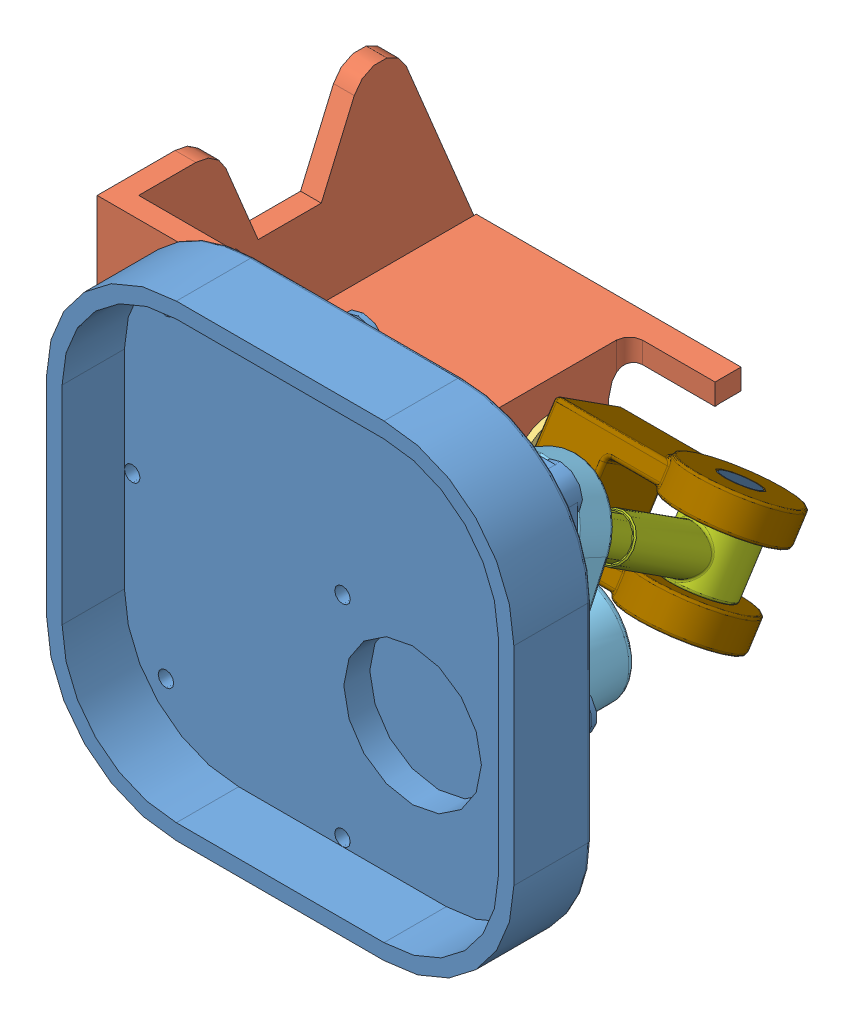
SolidWorks assembly Sinusmatic.sldasm, configuration Défaut (file format 4700). Lengths in mm.
Overall size (506 525.27 473.59).
18 component instances, 12 part files, 8 mates.
Components (placement in the parent):
- Bati-1: Bati.sldasm [Défaut] at (34.0419 25.9639 91) size (406 360 356)
  - Reducteur-1: Reducteur.sldprt [Défaut] at (-252.4721 -127.2379 27) size (360 360 174)
  - Bati-1: Bati.sldprt [Défaut] at (-293.4721 42.2621 7) x (0 -1 0) z (1 0 0) size (301 276 243)
  - Bague-1: Bague.sldprt [Défaut] at (-134.4721 -7.2379 -190) x (-1 0 0) z (0 0.924225 -0.381849) size (50 68.6 68.6)
  - Bague-2: Bague.sldprt [Défaut] at (-298.4721 -7.2379 -190) x (1 0 0) z (0 0.094472 0.995528) size (50 68.6 68.6)
  - Vis-1: Vis.sldprt [M8-1.25] at (-208.4721 -71.2379 -9) x (0.133526 0.991045 0) z (0 0 -1) size (27 27 38.26)
  - Vis-2: Vis.sldprt [M8-1.25] at (-72.4721 52.7621 -9) x (0.375037 -0.92701 0) z (0 0 -1) size (27 27 38.26)
  - Vis-3: Vis.sldprt [M8-1.25] at (-208.4721 176.7621 -9) x (0.607105 -0.794622 0) z (0 0 -1) size (27 27 38.26)
- Plateau-1: Plateau.sldasm [Défaut] at (16.4935 140.2032 101.5403) x (0 1 0) z (-1 0 0) size (174.55 96 88.14)
  - Plateau-1: Plateau.sldprt [Défaut] at (-121.4772 3.5403 0.9236) size (174.55 96 88.14)
  - Loctite-1: Loctite.sldprt [Défaut] at (-36.6458 68.708 0.9236) x (-0.167203 -0.077968 -0.982835) z (0.890751 0.415364 -0.184488) size (59.2 20 59.2)
- Croisillon-1: Croisillon.sldprt [Défaut] at (15.5699 67.698 -22.8949) x (1 0 0) z (0 0.541128 0.84094) size (50 40 175.5)
- Rotule-1: Rotule.sldprt [Défaut] at (15.5699 103.5574 32.8323) x (-0.210373 0.822121 -0.529018) z (0.977621 0.176911 -0.113839) size (49 28 49)
- Porte-1: Porte.sldasm [Défaut] at (-193.5468 -0.1439 -86.8576) x (-1 0 0) z (0 -0.541128 -0.84094) size (420 268.69 253.92)
  - Arbrefourche-1: Arbrefourche.sldprt [Défaut] at (-93.1167 22.439 0) size (420 88 80)
  - Goupille-1: Goupille.sldprt [Défaut] at (-209.1167 66.439 0) x (-0.047297 0 -0.998881) z (0 -1 0) size (30 30 88)
  - Barre-1: Barre.sldprt [Défaut] at (97.8833 22.439 0) x (0 0.741413 -0.671049) z (-1 0 0) size (290 80 50)
  - Ecrou-1: Ecrou.sldprt [M8-1.25] at (122.8833 22.439 0) x (0 -0.171163 -0.985243) z (1 0 0) size (80 80 28.76)
Mates (geometry in assembly coordinates):
- Coïncidente1: coincident anti-aligned: plane of Bati-1/Reducteur-1 through (15.5699 18.726 98) normal (0 0 -1); plane of Plateau-1/Plateau-1 through (15.5699 -14.974 98) normal (0 0 1)
- Concentrique1: concentric anti-aligned: cylinder of Bati-1/Reducteur-1 through (15.5699 18.726 4) axis (0 0 1) radius 18.5; cylinder of Plateau-1/Plateau-1 through (15.5699 18.726 -3.2789) axis (0 0 -1) radius 18.5
- Coïncidente2: coincident: point of Plateau-1/Loctite-1; point of Rotule-1
- Concentrique2: concentric anti-aligned: cylinder of Croisillon-1 through (15.5699 100.1657 27.5615) axis (0 -0.541128 -0.84094) radius 14.6; cylinder of Rotule-1 through (15.5699 114.7597 50.2413) axis (0 0.541128 0.84094) radius 14.6
- Coïncidente3: coincident anti-aligned: plane of Bati-1/Bague-1 through (-100.4301 9.1797 -122.1056) normal (1 0 0); plane of Porte-1/Arbrefourche-1 through (-100.4301 -28.6227 -104.2065) normal (-1 0 0)
- Concentrique5: concentric aligned: cylinder of Croisillon-1 through (15.5699 1.9072 -88.1774) axis (0 0.84094 -0.541128) radius 15; cylinder of Porte-1/Goupille-1 through (15.5699 -18.2754 -75.1904) axis (0 0.84094 -0.541128) radius 15
- Concentrique6: concentric aligned: cylinder of Bati-1/Bague-1 through (-100.4301 18.726 -99) axis (1 0 0) radius 25; cylinder of Porte-1/Arbrefourche-1 through (-266.4301 18.726 -99) axis (1 0 0) radius 25
- A distance1: distance anti-aligned: plane of Croisillon-1 through (15.5699 35.5448 -109.8226) normal (0 0.84094 -0.541128); plane of Porte-1/Arbrefourche-1 through (65.884 59.3544 -72.8212) normal (0 -0.84094 0.541128)
